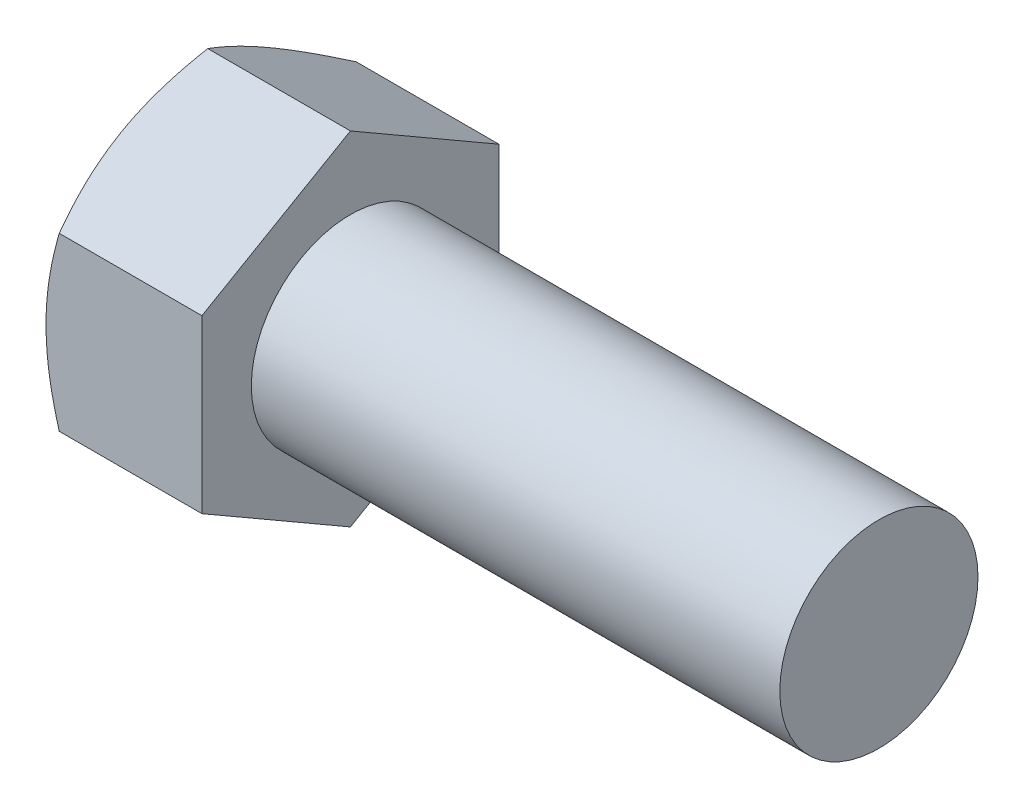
ISO-10303-21;
HEADER;
FILE_DESCRIPTION(('STEP AP214'),'2;1');
FILE_NAME('part.step','',(''),(''),'','','');
FILE_SCHEMA(('AUTOMOTIVE_DESIGN { 1 0 10303 214 1 1 1 1 }'));
ENDSEC;
DATA;
#1=APPLICATION_CONTEXT('core data for automotive mechanical design processes');
#2=APPLICATION_PROTOCOL_DEFINITION('international standard','automotive_design',2000,#1);
#3=PRODUCT_CONTEXT('',#1,'mechanical');
#4=PRODUCT('Part','Part','',(#3));
#5=PRODUCT_RELATED_PRODUCT_CATEGORY('part','',(#4));
#6=PRODUCT_DEFINITION_FORMATION('','',#4);
#7=PRODUCT_DEFINITION_CONTEXT('part definition',#1,'design');
#8=PRODUCT_DEFINITION('design','',#6,#7);
#9=PRODUCT_DEFINITION_SHAPE('','',#8);
#10=(LENGTH_UNIT() NAMED_UNIT(*) SI_UNIT(.MILLI.,.METRE.));
#11=(NAMED_UNIT(*) PLANE_ANGLE_UNIT() SI_UNIT($,.RADIAN.));
#12=(NAMED_UNIT(*) SI_UNIT($,.STERADIAN.) SOLID_ANGLE_UNIT());
#13=UNCERTAINTY_MEASURE_WITH_UNIT(LENGTH_MEASURE(1.E-05),#10,'distance_accuracy_value','');
#14=(GEOMETRIC_REPRESENTATION_CONTEXT(3) GLOBAL_UNCERTAINTY_ASSIGNED_CONTEXT((#13)) GLOBAL_UNIT_ASSIGNED_CONTEXT((#10,
#11,#12)) REPRESENTATION_CONTEXT('',''));
#15=CARTESIAN_POINT('',(0.,0.,0.));
#16=DIRECTION('',(0.,0.,1.));
#17=DIRECTION('',(1.,0.,0.));
#18=AXIS2_PLACEMENT_3D('',#15,#16,#17);
#19=CARTESIAN_POINT('',(0.,0.,0.));
#20=DIRECTION('',(-1.,0.,0.));
#21=DIRECTION('',(0.,0.,1.));
#22=AXIS2_PLACEMENT_3D('',#19,#20,#21);
#23=PLANE('',#22);
#24=CARTESIAN_POINT('',(0.,0.,0.));
#25=DIRECTION('',(-1.,0.,0.));
#26=DIRECTION('',(0.,0.,1.));
#27=AXIS2_PLACEMENT_3D('',#24,#25,#26);
#28=CIRCLE('',#27,7.1374);
#29=CARTESIAN_POINT('',(0.,0.,7.1374));
#30=VERTEX_POINT('',#29);
#31=CARTESIAN_POINT('',(0.,6.18116973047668,3.56870002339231));
#32=VERTEX_POINT('',#31);
#33=EDGE_CURVE('E40',#30,#32,#28,.T.);
#34=ORIENTED_EDGE('',*,*,#33,.T.);
#35=CARTESIAN_POINT('',(0.,6.18116973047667,-3.56870002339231));
#36=VERTEX_POINT('',#35);
#37=EDGE_CURVE('E196',#32,#36,#28,.T.);
#38=ORIENTED_EDGE('',*,*,#37,.T.);
#39=CARTESIAN_POINT('',(0.,0.,-7.1374));
#40=VERTEX_POINT('',#39);
#41=EDGE_CURVE('E201',#36,#40,#28,.T.);
#42=ORIENTED_EDGE('',*,*,#41,.T.);
#43=CARTESIAN_POINT('',(0.,-6.18116973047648,-3.5687000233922));
#44=VERTEX_POINT('',#43);
#45=EDGE_CURVE('E205',#40,#44,#28,.T.);
#46=ORIENTED_EDGE('',*,*,#45,.T.);
#47=CARTESIAN_POINT('',(0.,-6.18116973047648,3.5687000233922));
#48=VERTEX_POINT('',#47);
#49=EDGE_CURVE('E202',#44,#48,#28,.T.);
#50=ORIENTED_EDGE('',*,*,#49,.T.);
#51=EDGE_CURVE('E194',#48,#30,#28,.T.);
#52=ORIENTED_EDGE('',*,*,#51,.T.);
#53=EDGE_LOOP('',(#34,#38,#42,#46,#50,#52));
#54=FACE_BOUND('',#53,.T.);
#55=CARTESIAN_POINT('',(0.,0.,0.));
#56=DIRECTION('',(1.,0.,0.));
#57=DIRECTION('',(0.,0.,-1.));
#58=AXIS2_PLACEMENT_3D('',#55,#56,#57);
#59=CIRCLE('',#58,6.245225);
#60=CARTESIAN_POINT('',(0.,0.,-6.245225));
#61=VERTEX_POINT('',#60);
#62=EDGE_CURVE('E233',#61,#61,#59,.T.);
#63=ORIENTED_EDGE('',*,*,#62,.T.);
#64=EDGE_LOOP('',(#63));
#65=FACE_BOUND('',#64,.T.);
#66=ADVANCED_FACE('F32',(#54,#65),#23,.T.);
#67=CARTESIAN_POINT('',(7.493,4.7625,0.));
#68=DIRECTION('',(-1.,0.,0.));
#69=DIRECTION('',(0.,0.,1.));
#70=AXIS2_PLACEMENT_3D('',#67,#68,#69);
#71=PLANE('',#70);
#72=CARTESIAN_POINT('',(7.493,0.,0.));
#73=DIRECTION('',(-1.,0.,0.));
#74=DIRECTION('',(0.,0.,1.));
#75=AXIS2_PLACEMENT_3D('',#72,#73,#74);
#76=CIRCLE('',#75,4.7625);
#77=CARTESIAN_POINT('',(7.493,0.,4.7625));
#78=VERTEX_POINT('',#77);
#79=EDGE_CURVE('E192',#78,#78,#76,.T.);
#80=ORIENTED_EDGE('',*,*,#79,.T.);
#81=EDGE_LOOP('',(#80));
#82=FACE_BOUND('',#81,.T.);
#83=DIRECTION('',(0.,1.,0.));
#84=VECTOR('',#83,1.);
#85=CARTESIAN_POINT('',(7.493,-4.12077982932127,7.1374));
#86=LINE('',#85,#84);
#87=CARTESIAN_POINT('',(7.493,-4.12077982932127,7.1374));
#88=VERTEX_POINT('',#87);
#89=CARTESIAN_POINT('',(7.493,4.12077982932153,7.1374));
#90=VERTEX_POINT('',#89);
#91=EDGE_CURVE('E55',#88,#90,#86,.T.);
#92=ORIENTED_EDGE('',*,*,#91,.F.);
#93=DIRECTION('',(0.,0.50000000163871,0.866025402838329));
#94=VECTOR('',#93,1.);
#95=CARTESIAN_POINT('',(7.493,-8.24155965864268,0.));
#96=LINE('',#95,#94);
#97=CARTESIAN_POINT('',(7.493,-8.24155965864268,0.));
#98=VERTEX_POINT('',#97);
#99=EDGE_CURVE('E129',#98,#88,#96,.T.);
#100=ORIENTED_EDGE('',*,*,#99,.F.);
#101=DIRECTION('',(0.,-0.50000000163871,0.866025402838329));
#102=VECTOR('',#101,1.);
#103=CARTESIAN_POINT('',(7.493,-4.12077982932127,-7.1374));
#104=LINE('',#103,#102);
#105=CARTESIAN_POINT('',(7.493,-4.12077982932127,-7.1374));
#106=VERTEX_POINT('',#105);
#107=EDGE_CURVE('E127',#106,#98,#104,.T.);
#108=ORIENTED_EDGE('',*,*,#107,.F.);
#109=DIRECTION('',(0.,-1.,0.));
#110=VECTOR('',#109,1.);
#111=CARTESIAN_POINT('',(7.493,4.12077982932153,-7.1374));
#112=LINE('',#111,#110);
#113=CARTESIAN_POINT('',(7.493,4.12077982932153,-7.1374));
#114=VERTEX_POINT('',#113);
#115=EDGE_CURVE('E109',#114,#106,#112,.T.);
#116=ORIENTED_EDGE('',*,*,#115,.F.);
#117=DIRECTION('',(0.,-0.50000000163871,-0.866025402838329));
#118=VECTOR('',#117,1.);
#119=CARTESIAN_POINT('',(7.493,8.24155965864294,0.));
#120=LINE('',#119,#118);
#121=CARTESIAN_POINT('',(7.493,8.24155965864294,0.));
#122=VERTEX_POINT('',#121);
#123=EDGE_CURVE('E118',#122,#114,#120,.T.);
#124=ORIENTED_EDGE('',*,*,#123,.F.);
#125=DIRECTION('',(0.,0.50000000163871,-0.866025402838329));
#126=VECTOR('',#125,1.);
#127=CARTESIAN_POINT('',(7.493,4.12077982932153,7.1374));
#128=LINE('',#127,#126);
#129=EDGE_CURVE('E122',#90,#122,#128,.T.);
#130=ORIENTED_EDGE('',*,*,#129,.F.);
#131=EDGE_LOOP('',(#92,#100,#108,#116,#124,#130));
#132=FACE_BOUND('',#131,.T.);
#133=ADVANCED_FACE('F124',(#82,#132),#71,.F.);
#134=CARTESIAN_POINT('',(-25.4,0.,0.));
#135=DIRECTION('',(-1.,0.,0.));
#136=DIRECTION('',(0.,0.,1.));
#137=AXIS2_PLACEMENT_3D('',#134,#135,#136);
#138=CYLINDRICAL_SURFACE('',#137,4.7625);
#139=CARTESIAN_POINT('',(32.893,0.,0.));
#140=DIRECTION('',(-1.,0.,0.));
#141=DIRECTION('',(0.,0.,1.));
#142=AXIS2_PLACEMENT_3D('',#139,#140,#141);
#143=CIRCLE('',#142,4.7625);
#144=CARTESIAN_POINT('',(32.893,0.,4.7625));
#145=VERTEX_POINT('',#144);
#146=EDGE_CURVE('E11',#145,#145,#143,.T.);
#147=ORIENTED_EDGE('',*,*,#146,.T.);
#148=EDGE_LOOP('',(#147));
#149=FACE_BOUND('',#148,.T.);
#150=ORIENTED_EDGE('',*,*,#79,.F.);
#151=EDGE_LOOP('',(#150));
#152=FACE_BOUND('',#151,.T.);
#153=ADVANCED_FACE('F34',(#149,#152),#138,.T.);
#154=CARTESIAN_POINT('',(32.893,4.7625,0.));
#155=DIRECTION('',(1.,0.,0.));
#156=DIRECTION('',(0.,0.,-1.));
#157=AXIS2_PLACEMENT_3D('',#154,#155,#156);
#158=PLANE('',#157);
#159=ORIENTED_EDGE('',*,*,#146,.F.);
#160=EDGE_LOOP('',(#159));
#161=FACE_BOUND('',#160,.T.);
#162=ADVANCED_FACE('F175',(#161),#158,.T.);
#163=CARTESIAN_POINT('',(7.493,-4.12077982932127,7.1374));
#164=DIRECTION('',(0.,0.,1.));
#165=DIRECTION('',(1.,0.,0.));
#166=AXIS2_PLACEMENT_3D('',#163,#164,#165);
#167=PLANE('',#166);
#168=DIRECTION('',(-1.,0.,0.));
#169=VECTOR('',#168,1.);
#170=CARTESIAN_POINT('',(7.493,-4.12077982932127,7.1374));
#171=LINE('',#170,#169);
#172=CARTESIAN_POINT('',(0.637486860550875,-4.12077982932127,7.1374));
#173=VERTEX_POINT('',#172);
#174=EDGE_CURVE('E136',#88,#173,#171,.T.);
#175=ORIENTED_EDGE('',*,*,#174,.F.);
#176=ORIENTED_EDGE('',*,*,#91,.T.);
#177=DIRECTION('',(-1.,0.,0.));
#178=VECTOR('',#177,1.);
#179=CARTESIAN_POINT('',(7.493,4.12077982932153,7.1374));
#180=LINE('',#179,#178);
#181=CARTESIAN_POINT('',(0.637486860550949,4.12077982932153,7.1374));
#182=VERTEX_POINT('',#181);
#183=EDGE_CURVE('E135',#90,#182,#180,.T.);
#184=ORIENTED_EDGE('',*,*,#183,.T.);
#185=CARTESIAN_POINT('',(3.41544587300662,-10.9289347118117,7.1374));
#186=CARTESIAN_POINT('',(3.26400695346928,-10.6155623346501,7.1374));
#187=CARTESIAN_POINT('',(3.11407345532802,-10.3014490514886,7.1374));
#188=CARTESIAN_POINT('',(2.81807755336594,-9.67134004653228,7.1374));
#189=CARTESIAN_POINT('',(2.6720158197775,-9.35534401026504,7.1374));
#190=CARTESIAN_POINT('',(2.38385424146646,-8.71936189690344,7.1374));
#191=CARTESIAN_POINT('',(2.24178185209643,-8.39936333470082,7.1374));
#192=CARTESIAN_POINT('',(1.9637393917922,-7.7567361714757,7.1374));
#193=CARTESIAN_POINT('',(1.82776900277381,-7.43410770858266,7.1374));
#194=CARTESIAN_POINT('',(1.56193891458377,-6.78170205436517,7.1374));
#195=CARTESIAN_POINT('',(1.43217473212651,-6.45188572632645,7.1374));
#196=CARTESIAN_POINT('',(1.18280932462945,-5.78836373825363,7.1374));
#197=CARTESIAN_POINT('',(1.06320923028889,-5.45465765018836,7.1374));
#198=CARTESIAN_POINT('',(0.837386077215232,-4.78350650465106,7.1374));
#199=CARTESIAN_POINT('',(0.731134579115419,-4.44607112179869,7.1374));
#200=CARTESIAN_POINT('',(0.53545756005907,-3.76641539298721,7.1374));
#201=CARTESIAN_POINT('',(0.446026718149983,-3.42419659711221,7.1374));
#202=CARTESIAN_POINT('',(0.288339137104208,-2.73468312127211,7.1374));
#203=CARTESIAN_POINT('',(0.220088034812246,-2.38738711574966,7.1374));
#204=CARTESIAN_POINT('',(0.137013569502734,-1.86338701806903,7.1374));
#205=CARTESIAN_POINT('',(0.112537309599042,-1.68818947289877,7.1374));
#206=CARTESIAN_POINT('',(0.0705004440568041,-1.33697297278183,7.1374));
#207=CARTESIAN_POINT('',(0.0529391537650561,-1.16095410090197,7.1374));
#208=CARTESIAN_POINT('',(0.025204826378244,-0.809449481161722,7.1374));
#209=CARTESIAN_POINT('',(0.0149859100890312,-0.633967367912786,7.1374));
#210=CARTESIAN_POINT('',(0.00199035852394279,-0.282727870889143,7.1374));
#211=CARTESIAN_POINT('',(-0.000786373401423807,-0.106970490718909,7.1374));
#212=CARTESIAN_POINT('',(0.00116860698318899,0.244453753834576,7.1374));
#213=CARTESIAN_POINT('',(0.00589821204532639,0.420120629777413,7.1374));
#214=CARTESIAN_POINT('',(0.0227482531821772,0.771101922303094,7.1374));
#215=CARTESIAN_POINT('',(0.0348690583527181,0.946416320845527,7.1374));
#216=CARTESIAN_POINT('',(0.0729504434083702,1.37132382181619,7.1374));
#217=CARTESIAN_POINT('',(0.102614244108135,1.62059046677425,7.1374));
#218=CARTESIAN_POINT('',(0.175237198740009,2.11721366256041,7.1374));
#219=CARTESIAN_POINT('',(0.218199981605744,2.36456967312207,7.1374));
#220=CARTESIAN_POINT('',(0.315897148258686,2.85716752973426,7.1374));
#221=CARTESIAN_POINT('',(0.370642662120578,3.1024071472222,7.1374));
#222=CARTESIAN_POINT('',(0.490234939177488,3.59036322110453,7.1374));
#223=CARTESIAN_POINT('',(0.555080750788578,3.83307991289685,7.1374));
#224=CARTESIAN_POINT('',(0.695017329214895,4.32196822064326,7.1374));
#225=CARTESIAN_POINT('',(0.770320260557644,4.56807868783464,7.1374));
#226=CARTESIAN_POINT('',(0.928366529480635,5.05769822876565,7.1374));
#227=CARTESIAN_POINT('',(1.01110473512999,5.30120896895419,7.1374));
#228=CARTESIAN_POINT('',(1.18231251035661,5.78465193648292,7.1374));
#229=CARTESIAN_POINT('',(1.27074719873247,6.02459659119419,7.1374));
#230=CARTESIAN_POINT('',(1.45280721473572,6.50262425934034,7.1374));
#231=CARTESIAN_POINT('',(1.54643464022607,6.74070647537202,7.1374));
#232=CARTESIAN_POINT('',(1.64214475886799,6.97792376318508,7.1374));
#233=B_SPLINE_CURVE_WITH_KNOTS('',3,(#185,#186,#187,#188,#189,#190,#191,#192,#193,#194,#195,
#196,#197,#198,#199,#200,#201,#202,#203,#204,#205,#206,#207,#208,#209,#210,#211,#212,#213,#214,
#215,#216,#217,#218,#219,#220,#221,#222,#223,#224,#225,#226,#227,#228,#229,#230,#231,#232),
.UNSPECIFIED.,.F.,.F.,(4,2,2,2,2,2,2,2,2,2,2,2,2,2,2,2,2,2,2,2,2,2,2,4),(0.,1.0441518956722,
2.08848337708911,3.13879111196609,4.18904403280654,5.25219109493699,6.31545627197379,
7.37641628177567,8.43704010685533,9.49794596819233,10.0285279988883,10.559057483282,
11.0862423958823,11.6134204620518,12.1404505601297,12.6675069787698,13.4201640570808,
14.1730266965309,14.9266036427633,15.6801096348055,16.4520857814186,17.2235331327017,
17.9906382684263,18.7580556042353),.UNSPECIFIED.);
#234=EDGE_CURVE('E177',#30,#182,#233,.T.);
#235=ORIENTED_EDGE('',*,*,#234,.F.);
#236=EDGE_CURVE('E184',#173,#30,#233,.T.);
#237=ORIENTED_EDGE('',*,*,#236,.F.);
#238=EDGE_LOOP('',(#175,#176,#184,#235,#237));
#239=FACE_BOUND('',#238,.T.);
#240=ADVANCED_FACE('F171',(#239),#167,.T.);
#241=CARTESIAN_POINT('',(7.493,-8.24155965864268,0.));
#242=DIRECTION('',(0.,-0.866025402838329,0.50000000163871));
#243=DIRECTION('',(0.,-0.50000000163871,-0.866025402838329));
#244=AXIS2_PLACEMENT_3D('',#241,#242,#243);
#245=PLANE('',#244);
#246=DIRECTION('',(-1.,0.,0.));
#247=VECTOR('',#246,1.);
#248=CARTESIAN_POINT('',(7.493,-8.24155965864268,0.));
#249=LINE('',#248,#247);
#250=CARTESIAN_POINT('',(0.637486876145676,-8.24155965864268,0.));
#251=VERTEX_POINT('',#250);
#252=EDGE_CURVE('E140',#98,#251,#249,.T.);
#253=ORIENTED_EDGE('',*,*,#252,.F.);
#254=ORIENTED_EDGE('',*,*,#99,.T.);
#255=ORIENTED_EDGE('',*,*,#174,.T.);
#256=CARTESIAN_POINT('',(0.637553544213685,-8.24167512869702,-0.00019999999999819));
#257=CARTESIAN_POINT('',(0.585265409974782,-8.15109575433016,0.156688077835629));
#258=CARTESIAN_POINT('',(0.535350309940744,-8.06017865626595,0.314161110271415));
#259=CARTESIAN_POINT('',(0.440919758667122,-7.87760611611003,0.630386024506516));
#260=CARTESIAN_POINT('',(0.396406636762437,-7.78595037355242,0.789138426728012));
#261=CARTESIAN_POINT('',(0.271843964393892,-7.50951562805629,1.26793744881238));
#262=CARTESIAN_POINT('',(0.200994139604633,-7.32364544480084,1.58987404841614));
#263=CARTESIAN_POINT('',(0.11791437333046,-7.04549409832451,2.07164631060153));
#264=CARTESIAN_POINT('',(0.0942473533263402,-6.95404401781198,2.23004249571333));
#265=CARTESIAN_POINT('',(0.0545612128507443,-6.77073064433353,2.54755057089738));
#266=CARTESIAN_POINT('',(0.038541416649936,-6.67886738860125,2.70666239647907));
#267=CARTESIAN_POINT('',(0.0145579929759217,-6.49498133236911,3.0251623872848));
#268=CARTESIAN_POINT('',(0.00658522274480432,-6.40295883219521,3.18455003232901));
#269=CARTESIAN_POINT('',(-0.00114174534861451,-6.2188339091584,3.50346375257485));
#270=CARTESIAN_POINT('',(-0.000896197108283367,-6.12673148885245,3.6629898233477));
#271=CARTESIAN_POINT('',(0.0110730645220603,-5.87440163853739,4.10003794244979));
#272=CARTESIAN_POINT('',(0.0311658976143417,-5.71425680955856,4.37741692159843));
#273=CARTESIAN_POINT('',(0.0948800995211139,-5.39503081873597,4.93033255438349));
#274=CARTESIAN_POINT('',(0.13852324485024,-5.23595077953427,5.20586726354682));
#275=CARTESIAN_POINT('',(0.247618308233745,-4.91608236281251,5.75989561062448));
#276=CARTESIAN_POINT('',(0.313532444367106,-4.75533434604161,6.03831934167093));
#277=CARTESIAN_POINT('',(0.463130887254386,-4.43623550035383,6.59101475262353));
#278=CARTESIAN_POINT('',(0.546780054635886,-4.2778805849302,6.86529351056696));
#279=CARTESIAN_POINT('',(0.637553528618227,-4.12066435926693,7.1376));
#280=B_SPLINE_CURVE_WITH_KNOTS('',3,(#256,#257,#258,#259,#260,#261,#262,#263,#264,#265,#266,
#267,#268,#269,#270,#271,#272,#273,#274,#275,#276,#277,#278,#279),.UNSPECIFIED.,.F.,.F.,(4,2,2,
2,2,2,2,2,2,2,2,4),(0.,0.565616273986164,1.1314755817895,2.26554548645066,2.81869147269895,
3.37178857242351,3.92425655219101,4.47670746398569,5.43845616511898,6.40109570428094,
7.38508512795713,8.36714284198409),.UNSPECIFIED.);
#281=EDGE_CURVE('E186',#48,#173,#280,.T.);
#282=ORIENTED_EDGE('',*,*,#281,.F.);
#283=EDGE_CURVE('E185',#251,#48,#280,.T.);
#284=ORIENTED_EDGE('',*,*,#283,.F.);
#285=EDGE_LOOP('',(#253,#254,#255,#282,#284));
#286=FACE_BOUND('',#285,.T.);
#287=ADVANCED_FACE('F174',(#286),#245,.T.);
#288=CARTESIAN_POINT('',(7.493,-4.12077982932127,-7.1374));
#289=DIRECTION('',(0.,-0.866025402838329,-0.50000000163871));
#290=DIRECTION('',(0.,0.50000000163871,-0.866025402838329));
#291=AXIS2_PLACEMENT_3D('',#288,#289,#290);
#292=PLANE('',#291);
#293=DIRECTION('',(-1.,0.,0.));
#294=VECTOR('',#293,1.);
#295=CARTESIAN_POINT('',(7.493,-4.12077982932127,-7.1374));
#296=LINE('',#295,#294);
#297=CARTESIAN_POINT('',(0.637486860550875,-4.12077982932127,-7.1374));
#298=VERTEX_POINT('',#297);
#299=EDGE_CURVE('E115',#106,#298,#296,.T.);
#300=ORIENTED_EDGE('',*,*,#299,.F.);
#301=ORIENTED_EDGE('',*,*,#107,.T.);
#302=ORIENTED_EDGE('',*,*,#252,.T.);
#303=CARTESIAN_POINT('',(0.637553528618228,-4.12066435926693,-7.1376));
#304=CARTESIAN_POINT('',(0.585265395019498,-4.21124373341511,-6.98071192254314));
#305=CARTESIAN_POINT('',(0.535350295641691,-4.30216083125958,-6.82323889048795));
#306=CARTESIAN_POINT('',(0.440919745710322,-4.48473337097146,-6.50701397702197));
#307=CARTESIAN_POINT('',(0.396406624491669,-4.57638911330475,-6.348261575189));
#308=CARTESIAN_POINT('',(0.271843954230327,-4.85282385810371,-5.86946255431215));
#309=CARTESIAN_POINT('',(0.200994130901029,-5.03869404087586,-5.54752595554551));
#310=CARTESIAN_POINT('',(0.117914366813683,-5.31684538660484,-5.06575369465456));
#311=CARTESIAN_POINT('',(0.0942473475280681,-5.40829546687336,-4.90735750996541));
#312=CARTESIAN_POINT('',(0.0545612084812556,-5.59160883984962,-4.58984943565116));
#313=CARTESIAN_POINT('',(0.0385414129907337,-5.68347209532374,-4.43073761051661));
#314=CARTESIAN_POINT('',(0.0145579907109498,-5.86735815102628,-4.11223762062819));
#315=CARTESIAN_POINT('',(0.00658522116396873,-5.95938065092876,-3.9528499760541));
#316=CARTESIAN_POINT('',(-0.00114174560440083,-6.14350557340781,-3.63393625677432));
#317=CARTESIAN_POINT('',(-0.000896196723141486,-6.23560799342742,-3.47441018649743));
#318=CARTESIAN_POINT('',(0.0110730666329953,-6.48793784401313,-3.03736206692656));
#319=CARTESIAN_POINT('',(0.0311659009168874,-6.64808267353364,-2.7599830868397));
#320=CARTESIAN_POINT('',(0.0948801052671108,-6.9673086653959,-2.20706745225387));
#321=CARTESIAN_POINT('',(0.138523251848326,-7.12638870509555,-1.93153274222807));
#322=CARTESIAN_POINT('',(0.247618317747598,-7.44625712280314,-1.37750439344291));
#323=CARTESIAN_POINT('',(0.313532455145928,-7.60700514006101,-1.099080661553));
#324=CARTESIAN_POINT('',(0.463130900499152,-7.92610398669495,-0.546385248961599));
#325=CARTESIAN_POINT('',(0.546780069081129,-8.08445890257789,-0.272106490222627));
#326=CARTESIAN_POINT('',(0.637553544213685,-8.24167512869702,0.000200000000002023));
#327=B_SPLINE_CURVE_WITH_KNOTS('',3,(#303,#304,#305,#306,#307,#308,#309,#310,#311,#312,#313,
#314,#315,#316,#317,#318,#319,#320,#321,#322,#323,#324,#325,#326),.UNSPECIFIED.,.F.,.F.,(4,2,2,
2,2,2,2,2,2,2,2,4),(0.,0.565616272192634,1.13147557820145,2.26554547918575,2.81869146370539,
3.37178856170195,3.92425653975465,4.47670744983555,5.43845615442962,6.40109569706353,
7.38508512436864,8.3671428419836),.UNSPECIFIED.);
#328=EDGE_CURVE('E215',#44,#251,#327,.T.);
#329=ORIENTED_EDGE('',*,*,#328,.F.);
#330=EDGE_CURVE('E220',#298,#44,#327,.T.);
#331=ORIENTED_EDGE('',*,*,#330,.F.);
#332=EDGE_LOOP('',(#300,#301,#302,#329,#331));
#333=FACE_BOUND('',#332,.T.);
#334=ADVANCED_FACE('F292',(#333),#292,.T.);
#335=CARTESIAN_POINT('',(7.493,4.12077982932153,-7.1374));
#336=DIRECTION('',(0.,0.,-1.));
#337=DIRECTION('',(0.,1.,0.));
#338=AXIS2_PLACEMENT_3D('',#335,#336,#337);
#339=PLANE('',#338);
#340=DIRECTION('',(-1.,0.,0.));
#341=VECTOR('',#340,1.);
#342=CARTESIAN_POINT('',(7.493,4.12077982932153,-7.1374));
#343=LINE('',#342,#341);
#344=CARTESIAN_POINT('',(0.637486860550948,4.12077982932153,-7.1374));
#345=VERTEX_POINT('',#344);
#346=EDGE_CURVE('E104',#114,#345,#343,.T.);
#347=ORIENTED_EDGE('',*,*,#346,.F.);
#348=ORIENTED_EDGE('',*,*,#115,.T.);
#349=ORIENTED_EDGE('',*,*,#299,.T.);
#350=CARTESIAN_POINT('',(3.41544587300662,-10.9289347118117,-7.1374));
#351=CARTESIAN_POINT('',(3.26400695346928,-10.6155623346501,-7.13740000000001));
#352=CARTESIAN_POINT('',(3.11407345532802,-10.3014490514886,-7.1374));
#353=CARTESIAN_POINT('',(2.81807755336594,-9.67134004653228,-7.1374));
#354=CARTESIAN_POINT('',(2.6720158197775,-9.35534401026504,-7.1374));
#355=CARTESIAN_POINT('',(2.38385424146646,-8.71936189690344,-7.1374));
#356=CARTESIAN_POINT('',(2.24178185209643,-8.39936333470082,-7.1374));
#357=CARTESIAN_POINT('',(1.9637393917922,-7.7567361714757,-7.1374));
#358=CARTESIAN_POINT('',(1.82776900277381,-7.43410770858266,-7.1374));
#359=CARTESIAN_POINT('',(1.56193891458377,-6.78170205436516,-7.1374));
#360=CARTESIAN_POINT('',(1.43217473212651,-6.45188572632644,-7.1374));
#361=CARTESIAN_POINT('',(1.18280932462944,-5.78836373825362,-7.1374));
#362=CARTESIAN_POINT('',(1.06320923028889,-5.45465765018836,-7.1374));
#363=CARTESIAN_POINT('',(0.837386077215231,-4.78350650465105,-7.1374));
#364=CARTESIAN_POINT('',(0.731134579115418,-4.44607112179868,-7.1374));
#365=CARTESIAN_POINT('',(0.535457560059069,-3.76641539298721,-7.1374));
#366=CARTESIAN_POINT('',(0.446026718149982,-3.42419659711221,-7.1374));
#367=CARTESIAN_POINT('',(0.288339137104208,-2.73468312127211,-7.1374));
#368=CARTESIAN_POINT('',(0.220088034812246,-2.38738711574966,-7.1374));
#369=CARTESIAN_POINT('',(0.137013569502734,-1.86338701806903,-7.1374));
#370=CARTESIAN_POINT('',(0.112537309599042,-1.68818947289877,-7.1374));
#371=CARTESIAN_POINT('',(0.0705004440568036,-1.33697297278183,-7.1374));
#372=CARTESIAN_POINT('',(0.052939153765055,-1.16095410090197,-7.1374));
#373=CARTESIAN_POINT('',(0.0252048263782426,-0.809449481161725,-7.1374));
#374=CARTESIAN_POINT('',(0.0149859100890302,-0.633967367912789,-7.1374));
#375=CARTESIAN_POINT('',(0.00199035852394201,-0.282727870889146,-7.1374));
#376=CARTESIAN_POINT('',(-0.000786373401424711,-0.10697049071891,-7.1374));
#377=CARTESIAN_POINT('',(0.00116860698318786,0.244453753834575,-7.1374));
#378=CARTESIAN_POINT('',(0.00589821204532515,0.420120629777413,-7.1374));
#379=CARTESIAN_POINT('',(0.0227482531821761,0.771101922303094,-7.1374));
#380=CARTESIAN_POINT('',(0.0348690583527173,0.946416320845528,-7.1374));
#381=CARTESIAN_POINT('',(0.0729504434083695,1.37132382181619,-7.1374));
#382=CARTESIAN_POINT('',(0.102614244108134,1.62059046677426,-7.1374));
#383=CARTESIAN_POINT('',(0.175237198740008,2.11721366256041,-7.1374));
#384=CARTESIAN_POINT('',(0.218199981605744,2.36456967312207,-7.1374));
#385=CARTESIAN_POINT('',(0.315897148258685,2.85716752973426,-7.1374));
#386=CARTESIAN_POINT('',(0.370642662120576,3.1024071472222,-7.1374));
#387=CARTESIAN_POINT('',(0.490234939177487,3.59036322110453,-7.1374));
#388=CARTESIAN_POINT('',(0.555080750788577,3.83307991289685,-7.1374));
#389=CARTESIAN_POINT('',(0.695017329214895,4.32196822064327,-7.1374));
#390=CARTESIAN_POINT('',(0.770320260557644,4.56807868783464,-7.1374));
#391=CARTESIAN_POINT('',(0.928366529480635,5.05769822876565,-7.1374));
#392=CARTESIAN_POINT('',(1.01110473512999,5.30120896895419,-7.1374));
#393=CARTESIAN_POINT('',(1.18231251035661,5.78465193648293,-7.1374));
#394=CARTESIAN_POINT('',(1.27074719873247,6.02459659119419,-7.1374));
#395=CARTESIAN_POINT('',(1.45280721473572,6.50262425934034,-7.1374));
#396=CARTESIAN_POINT('',(1.54643464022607,6.74070647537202,-7.1374));
#397=CARTESIAN_POINT('',(1.64214475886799,6.97792376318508,-7.1374));
#398=B_SPLINE_CURVE_WITH_KNOTS('',3,(#350,#351,#352,#353,#354,#355,#356,#357,#358,#359,#360,
#361,#362,#363,#364,#365,#366,#367,#368,#369,#370,#371,#372,#373,#374,#375,#376,#377,#378,#379,
#380,#381,#382,#383,#384,#385,#386,#387,#388,#389,#390,#391,#392,#393,#394,#395,#396,#397),
.UNSPECIFIED.,.F.,.F.,(4,2,2,2,2,2,2,2,2,2,2,2,2,2,2,2,2,2,2,2,2,2,2,4),(0.,1.0441518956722,
2.08848337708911,3.13879111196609,4.18904403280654,5.25219109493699,6.31545627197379,
7.37641628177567,8.43704010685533,9.49794596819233,10.0285279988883,10.559057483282,
11.0862423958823,11.6134204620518,12.1404505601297,12.6675069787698,13.4201640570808,
14.1730266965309,14.9266036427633,15.6801096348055,16.4520857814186,17.2235331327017,
17.9906382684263,18.7580556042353),.UNSPECIFIED.);
#399=EDGE_CURVE('E216',#40,#298,#398,.F.);
#400=ORIENTED_EDGE('',*,*,#399,.F.);
#401=EDGE_CURVE('E112',#345,#40,#398,.F.);
#402=ORIENTED_EDGE('',*,*,#401,.F.);
#403=EDGE_LOOP('',(#347,#348,#349,#400,#402));
#404=FACE_BOUND('',#403,.T.);
#405=ADVANCED_FACE('F106',(#404),#339,.T.);
#406=CARTESIAN_POINT('',(7.493,8.24155965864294,0.));
#407=DIRECTION('',(0.,0.866025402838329,-0.50000000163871));
#408=DIRECTION('',(0.,0.50000000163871,0.866025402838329));
#409=AXIS2_PLACEMENT_3D('',#406,#407,#408);
#410=PLANE('',#409);
#411=DIRECTION('',(-1.,0.,0.));
#412=VECTOR('',#411,1.);
#413=CARTESIAN_POINT('',(7.493,8.24155965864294,0.));
#414=LINE('',#413,#412);
#415=CARTESIAN_POINT('',(0.637486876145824,8.24155965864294,0.));
#416=VERTEX_POINT('',#415);
#417=EDGE_CURVE('E47',#122,#416,#414,.T.);
#418=ORIENTED_EDGE('',*,*,#417,.F.);
#419=ORIENTED_EDGE('',*,*,#123,.T.);
#420=ORIENTED_EDGE('',*,*,#346,.T.);
#421=CARTESIAN_POINT('',(0.637553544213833,8.24167512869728,0.000200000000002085));
#422=CARTESIAN_POINT('',(0.585265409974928,8.15109575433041,-0.156688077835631));
#423=CARTESIAN_POINT('',(0.535350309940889,8.0601786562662,-0.314161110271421));
#424=CARTESIAN_POINT('',(0.440919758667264,7.87760611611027,-0.630386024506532));
#425=CARTESIAN_POINT('',(0.396406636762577,7.78595037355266,-0.789138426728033));
#426=CARTESIAN_POINT('',(0.271843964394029,7.50951562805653,-1.26793744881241));
#427=CARTESIAN_POINT('',(0.200994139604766,7.32364544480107,-1.58987404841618));
#428=CARTESIAN_POINT('',(0.117914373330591,7.04549409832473,-2.07164631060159));
#429=CARTESIAN_POINT('',(0.0942473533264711,6.95404401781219,-2.2300424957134));
#430=CARTESIAN_POINT('',(0.0545612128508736,6.77073064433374,-2.54755057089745));
#431=CARTESIAN_POINT('',(0.0385414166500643,6.67886738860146,-2.70666239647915));
#432=CARTESIAN_POINT('',(0.0145579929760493,6.49498133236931,-3.02516238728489));
#433=CARTESIAN_POINT('',(0.00658522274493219,6.40295883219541,-3.1845500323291));
#434=CARTESIAN_POINT('',(-0.00114174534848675,6.21883390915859,-3.50346375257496));
#435=CARTESIAN_POINT('',(-0.000896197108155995,6.12673148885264,-3.66298982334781));
#436=CARTESIAN_POINT('',(0.011073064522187,5.87440163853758,-4.10003794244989));
#437=CARTESIAN_POINT('',(0.0311658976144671,5.71425680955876,-4.37741692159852));
#438=CARTESIAN_POINT('',(0.094880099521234,5.39503081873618,-4.93033255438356));
#439=CARTESIAN_POINT('',(0.138523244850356,5.23595077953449,-5.20586726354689));
#440=CARTESIAN_POINT('',(0.247618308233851,4.91608236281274,-5.75989561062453));
#441=CARTESIAN_POINT('',(0.313532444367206,4.75533434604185,-6.03831934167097));
#442=CARTESIAN_POINT('',(0.463130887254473,4.43623550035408,-6.59101475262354));
#443=CARTESIAN_POINT('',(0.546780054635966,4.27788058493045,-6.86529351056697));
#444=CARTESIAN_POINT('',(0.6375535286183,4.12066435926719,-7.1376));
#445=B_SPLINE_CURVE_WITH_KNOTS('',3,(#421,#422,#423,#424,#425,#426,#427,#428,#429,#430,#431,
#432,#433,#434,#435,#436,#437,#438,#439,#440,#441,#442,#443,#444),.UNSPECIFIED.,.F.,.F.,(4,2,2,
2,2,2,2,2,2,2,2,4),(0.,0.565616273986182,1.13147558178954,2.26554548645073,2.81869147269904,
3.37178857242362,3.92425655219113,4.47670746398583,5.43845616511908,6.40109570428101,
7.38508512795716,8.36714284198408),.UNSPECIFIED.);
#446=EDGE_CURVE('E154',#36,#345,#445,.T.);
#447=ORIENTED_EDGE('',*,*,#446,.F.);
#448=EDGE_CURVE('E379',#416,#36,#445,.T.);
#449=ORIENTED_EDGE('',*,*,#448,.F.);
#450=EDGE_LOOP('',(#418,#419,#420,#447,#449));
#451=FACE_BOUND('',#450,.T.);
#452=ADVANCED_FACE('F119',(#451),#410,.T.);
#453=CARTESIAN_POINT('',(7.493,4.12077982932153,7.1374));
#454=DIRECTION('',(0.,0.866025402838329,0.50000000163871));
#455=DIRECTION('',(0.,-0.50000000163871,0.866025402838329));
#456=AXIS2_PLACEMENT_3D('',#453,#454,#455);
#457=PLANE('',#456);
#458=ORIENTED_EDGE('',*,*,#183,.F.);
#459=ORIENTED_EDGE('',*,*,#129,.T.);
#460=ORIENTED_EDGE('',*,*,#417,.T.);
#461=CARTESIAN_POINT('',(0.637553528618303,4.12066435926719,7.1376));
#462=CARTESIAN_POINT('',(0.585265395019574,4.21124373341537,6.98071192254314));
#463=CARTESIAN_POINT('',(0.535350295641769,4.30216083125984,6.82323889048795));
#464=CARTESIAN_POINT('',(0.440919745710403,4.48473337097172,6.50701397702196));
#465=CARTESIAN_POINT('',(0.396406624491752,4.57638911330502,6.34826157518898));
#466=CARTESIAN_POINT('',(0.271843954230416,4.85282385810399,5.86946255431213));
#467=CARTESIAN_POINT('',(0.200994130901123,5.03869404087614,5.54752595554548));
#468=CARTESIAN_POINT('',(0.117914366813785,5.31684538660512,5.06575369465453));
#469=CARTESIAN_POINT('',(0.0942473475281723,5.40829546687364,4.90735750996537));
#470=CARTESIAN_POINT('',(0.0545612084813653,5.59160883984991,4.58984943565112));
#471=CARTESIAN_POINT('',(0.0385414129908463,5.68347209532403,4.43073761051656));
#472=CARTESIAN_POINT('',(0.0145579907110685,5.86735815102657,4.11223762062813));
#473=CARTESIAN_POINT('',(0.00658522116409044,5.95938065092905,3.95284997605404));
#474=CARTESIAN_POINT('',(-0.00114174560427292,6.14350557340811,3.63393625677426));
#475=CARTESIAN_POINT('',(-0.000896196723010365,6.23560799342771,3.47441018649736));
#476=CARTESIAN_POINT('',(0.0110730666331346,6.48793784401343,3.0373620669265));
#477=CARTESIAN_POINT('',(0.0311659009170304,6.64808267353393,2.75998308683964));
#478=CARTESIAN_POINT('',(0.0948801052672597,6.96730866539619,2.20706745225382));
#479=CARTESIAN_POINT('',(0.138523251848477,7.12638870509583,1.93153274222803));
#480=CARTESIAN_POINT('',(0.247618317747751,7.44625712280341,1.37750439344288));
#481=CARTESIAN_POINT('',(0.313532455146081,7.60700514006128,1.09908066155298));
#482=CARTESIAN_POINT('',(0.463130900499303,7.92610398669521,0.546385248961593));
#483=CARTESIAN_POINT('',(0.546780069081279,8.08445890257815,0.272106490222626));
#484=CARTESIAN_POINT('',(0.637553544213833,8.24167512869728,-0.00019999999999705));
#485=B_SPLINE_CURVE_WITH_KNOTS('',3,(#461,#462,#463,#464,#465,#466,#467,#468,#469,#470,#471,
#472,#473,#474,#475,#476,#477,#478,#479,#480,#481,#482,#483,#484),.UNSPECIFIED.,.F.,.F.,(4,2,2,
2,2,2,2,2,2,2,2,4),(0.,0.565616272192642,1.13147557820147,2.26554547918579,2.81869146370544,
3.371788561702,3.92425653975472,4.47670744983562,5.43845615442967,6.40109569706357,
7.38508512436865,8.36714284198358),.UNSPECIFIED.);
#486=EDGE_CURVE('E139',#32,#416,#485,.T.);
#487=ORIENTED_EDGE('',*,*,#486,.F.);
#488=EDGE_CURVE('E153',#182,#32,#485,.T.);
#489=ORIENTED_EDGE('',*,*,#488,.F.);
#490=EDGE_LOOP('',(#458,#459,#460,#487,#489));
#491=FACE_BOUND('',#490,.T.);
#492=ADVANCED_FACE('F164',(#491),#457,.T.);
#493=CARTESIAN_POINT('',(0.,0.,0.));
#494=DIRECTION('',(1.,0.,0.));
#495=DIRECTION('',(0.,0.,-1.));
#496=AXIS2_PLACEMENT_3D('',#493,#494,#495);
#497=CONICAL_SURFACE('',#496,7.1374,1.0471975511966);
#498=ORIENTED_EDGE('',*,*,#51,.F.);
#499=ORIENTED_EDGE('',*,*,#281,.T.);
#500=ORIENTED_EDGE('',*,*,#236,.T.);
#501=EDGE_LOOP('',(#498,#499,#500));
#502=FACE_BOUND('',#501,.T.);
#503=ADVANCED_FACE('F168',(#502),#497,.T.);
#504=ORIENTED_EDGE('',*,*,#49,.F.);
#505=ORIENTED_EDGE('',*,*,#328,.T.);
#506=ORIENTED_EDGE('',*,*,#283,.T.);
#507=EDGE_LOOP('',(#504,#505,#506));
#508=FACE_BOUND('',#507,.T.);
#509=ADVANCED_FACE('F225',(#508),#497,.T.);
#510=ORIENTED_EDGE('',*,*,#399,.T.);
#511=ORIENTED_EDGE('',*,*,#330,.T.);
#512=ORIENTED_EDGE('',*,*,#45,.F.);
#513=EDGE_LOOP('',(#510,#511,#512));
#514=FACE_BOUND('',#513,.T.);
#515=ADVANCED_FACE('F160',(#514),#497,.T.);
#516=ORIENTED_EDGE('',*,*,#446,.T.);
#517=ORIENTED_EDGE('',*,*,#401,.T.);
#518=ORIENTED_EDGE('',*,*,#41,.F.);
#519=EDGE_LOOP('',(#516,#517,#518));
#520=FACE_BOUND('',#519,.T.);
#521=ADVANCED_FACE('F214',(#520),#497,.T.);
#522=ORIENTED_EDGE('',*,*,#33,.F.);
#523=ORIENTED_EDGE('',*,*,#234,.T.);
#524=ORIENTED_EDGE('',*,*,#488,.T.);
#525=EDGE_LOOP('',(#522,#523,#524));
#526=FACE_BOUND('',#525,.T.);
#527=ADVANCED_FACE('F251',(#526),#497,.T.);
#528=ORIENTED_EDGE('',*,*,#486,.T.);
#529=ORIENTED_EDGE('',*,*,#448,.T.);
#530=ORIENTED_EDGE('',*,*,#37,.F.);
#531=EDGE_LOOP('',(#528,#529,#530));
#532=FACE_BOUND('',#531,.T.);
#533=ADVANCED_FACE('F242',(#532),#497,.T.);
#534=CARTESIAN_POINT('',(0.936625,0.,0.));
#535=DIRECTION('',(-1.,0.,0.));
#536=DIRECTION('',(0.,0.,1.));
#537=AXIS2_PLACEMENT_3D('',#534,#535,#536);
#538=CYLINDRICAL_SURFACE('',#537,6.245225);
#539=CARTESIAN_POINT('',(0.936625,0.,0.));
#540=DIRECTION('',(1.,0.,0.));
#541=DIRECTION('',(0.,0.,-1.));
#542=AXIS2_PLACEMENT_3D('',#539,#540,#541);
#543=CIRCLE('',#542,6.245225);
#544=CARTESIAN_POINT('',(0.936625,0.,-6.245225));
#545=VERTEX_POINT('',#544);
#546=EDGE_CURVE('E230',#545,#545,#543,.T.);
#547=ORIENTED_EDGE('',*,*,#546,.T.);
#548=EDGE_LOOP('',(#547));
#549=FACE_BOUND('',#548,.T.);
#550=ORIENTED_EDGE('',*,*,#62,.F.);
#551=EDGE_LOOP('',(#550));
#552=FACE_BOUND('',#551,.T.);
#553=ADVANCED_FACE('F239',(#549,#552),#538,.F.);
#554=CARTESIAN_POINT('',(0.936625,0.,0.));
#555=DIRECTION('',(1.,0.,0.));
#556=DIRECTION('',(0.,0.,-1.));
#557=AXIS2_PLACEMENT_3D('',#554,#555,#556);
#558=PLANE('',#557);
#559=ORIENTED_EDGE('',*,*,#546,.F.);
#560=EDGE_LOOP('',(#559));
#561=FACE_BOUND('',#560,.T.);
#562=ADVANCED_FACE('F241',(#561),#558,.F.);
#563=CLOSED_SHELL('',(#66,#133,#153,#162,#240,#287,#334,#405,#452,#492,#503,#509,#515,#521,#527,
#533,#553,#562));
#564=MANIFOLD_SOLID_BREP('B2',#563);
#565=ADVANCED_BREP_SHAPE_REPRESENTATION('',(#18,#564),#14);
#566=SHAPE_DEFINITION_REPRESENTATION(#9,#565);
ENDSEC;
END-ISO-10303-21;
